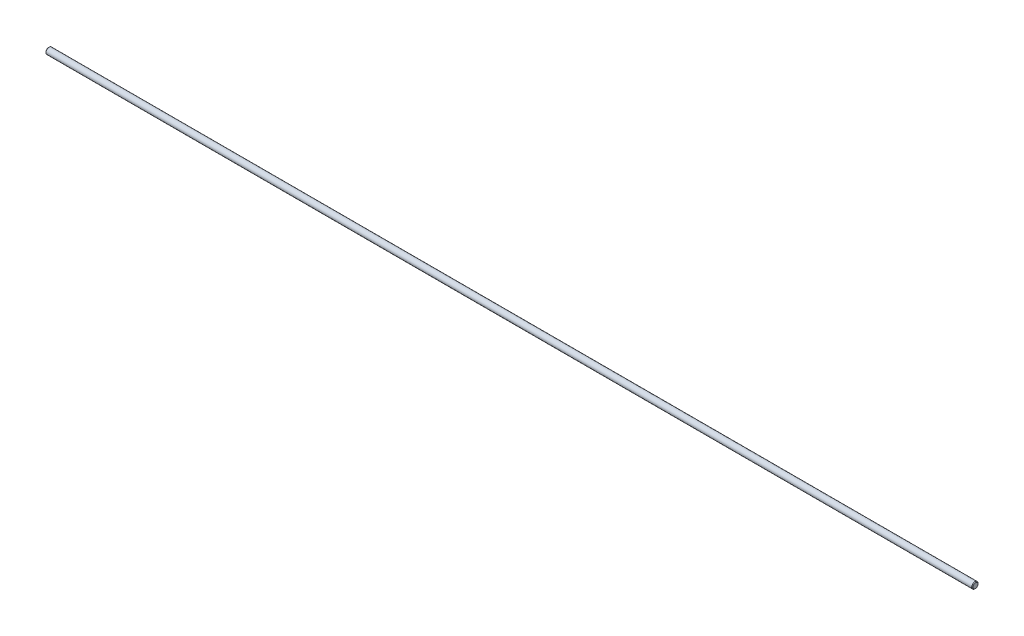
from build123d import *

# Parameters (mm, degrees)
ESQUISSE1_R      = 5
EXTRUSION1_DEPTH = 739
CHANFREIN1_SIZE  = 1


with BuildPart() as part:
    # Esquisse1 → Extrusion1 (new, symmetric)
    with BuildSketch(Plane(origin=(0, 0, 0), x_dir=(0, 0, -1), z_dir=(1, 0, 0))):
        with Locations(Location((0, 0, 0), (0, 0, 180))):
            Circle(ESQUISSE1_R)
    extrude(amount=EXTRUSION1_DEPTH, both=True)

    # Chanfrein1
    chanfrein1_edges = [part.edges().sort_by_distance(p)[0] for p in [
        (-739, 0, -5),
        (739, 0, -5),
    ]]
    chamfer(chanfrein1_edges, length=CHANFREIN1_SIZE)


solid = part.part
